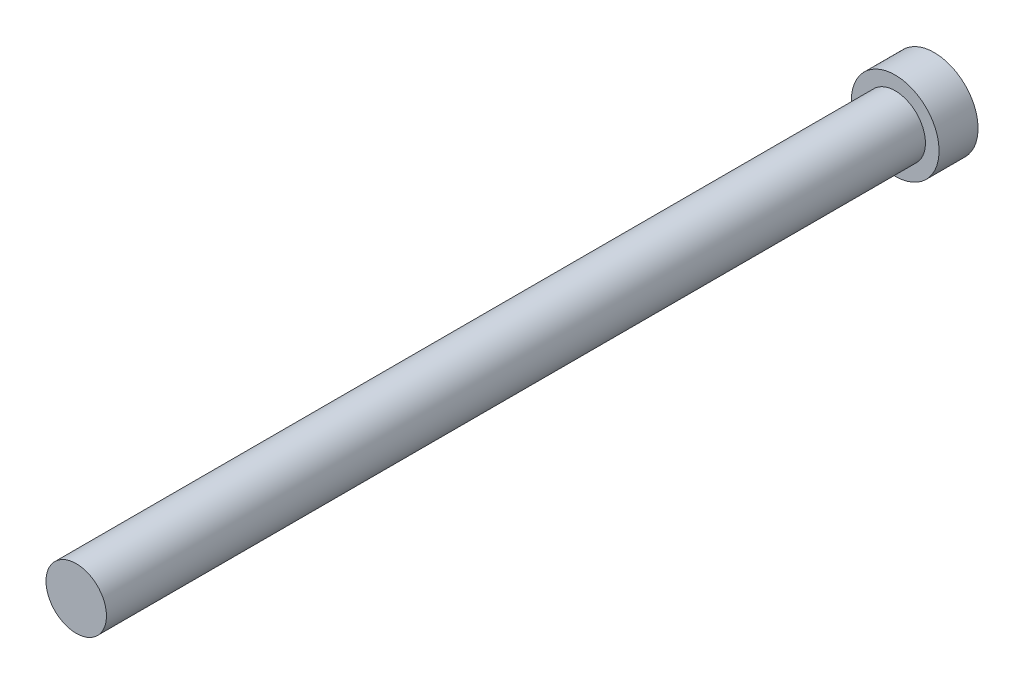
from build123d import *

# Parameters (mm, degrees)
ESQUISSE1_R          = 3.1
BASE_EXTRUSION_DEPTH = 88
ESQUISSE2_R          = 4.5
BOSS_EXTRU_1_DEPTH   = 4


with BuildPart() as part:
    # Esquisse1 → Base-Extrusion (new body)
    with BuildSketch(Plane.XY):
        Circle(ESQUISSE1_R)
    extrude(amount=BASE_EXTRUSION_DEPTH)

    # Esquisse2 → Boss.-Extru.1 (add)
    with BuildSketch(Plane(origin=(0, 0, 0), x_dir=(-1, 0, 0), z_dir=(0, 0, -1))):
        Circle(ESQUISSE2_R)
    extrude(amount=-BOSS_EXTRU_1_DEPTH)


solid = part.part
